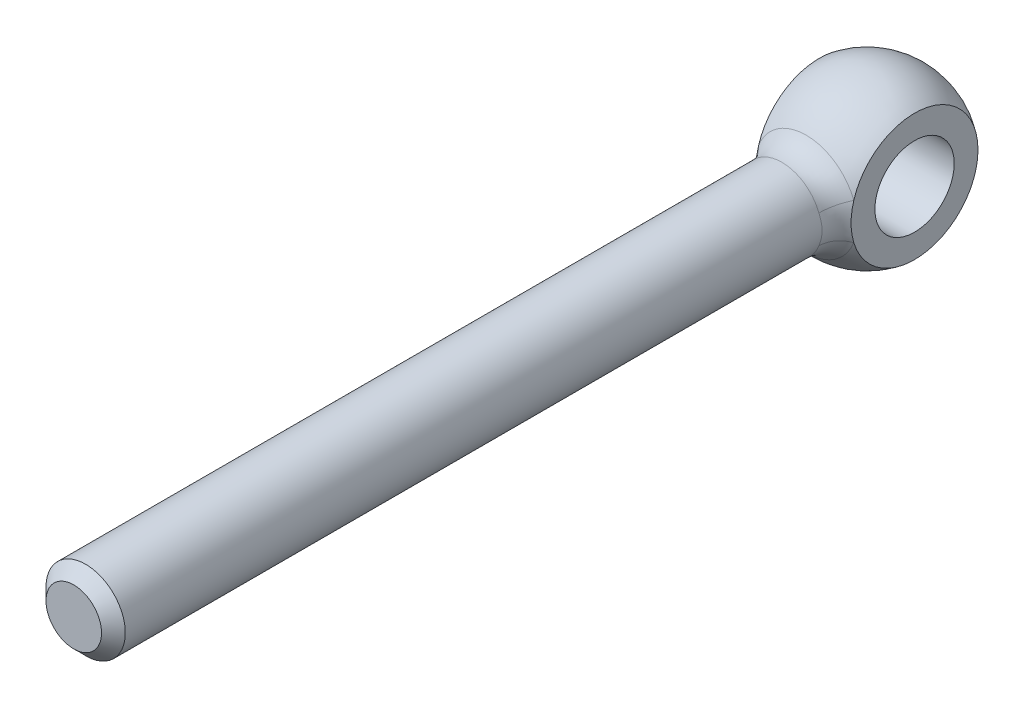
ISO-10303-21;
HEADER;
FILE_DESCRIPTION(('STEP AP214'),'2;1');
FILE_NAME('part.step','',(''),(''),'','','');
FILE_SCHEMA(('AUTOMOTIVE_DESIGN { 1 0 10303 214 1 1 1 1 }'));
ENDSEC;
DATA;
#1=APPLICATION_CONTEXT('core data for automotive mechanical design processes');
#2=APPLICATION_PROTOCOL_DEFINITION('international standard','automotive_design',2000,#1);
#3=PRODUCT_CONTEXT('',#1,'mechanical');
#4=PRODUCT('Part','Part','',(#3));
#5=PRODUCT_RELATED_PRODUCT_CATEGORY('part','',(#4));
#6=PRODUCT_DEFINITION_FORMATION('','',#4);
#7=PRODUCT_DEFINITION_CONTEXT('part definition',#1,'design');
#8=PRODUCT_DEFINITION('design','',#6,#7);
#9=PRODUCT_DEFINITION_SHAPE('','',#8);
#10=(LENGTH_UNIT() NAMED_UNIT(*) SI_UNIT(.MILLI.,.METRE.));
#11=(NAMED_UNIT(*) PLANE_ANGLE_UNIT() SI_UNIT($,.RADIAN.));
#12=(NAMED_UNIT(*) SI_UNIT($,.STERADIAN.) SOLID_ANGLE_UNIT());
#13=UNCERTAINTY_MEASURE_WITH_UNIT(LENGTH_MEASURE(1.E-05),#10,'distance_accuracy_value','');
#14=(GEOMETRIC_REPRESENTATION_CONTEXT(3) GLOBAL_UNCERTAINTY_ASSIGNED_CONTEXT((#13)) GLOBAL_UNIT_ASSIGNED_CONTEXT((#10,
#11,#12)) REPRESENTATION_CONTEXT('',''));
#15=CARTESIAN_POINT('',(0.,0.,0.));
#16=DIRECTION('',(0.,0.,1.));
#17=DIRECTION('',(1.,0.,0.));
#18=AXIS2_PLACEMENT_3D('',#15,#16,#17);
#19=CARTESIAN_POINT('',(0.,0.,0.));
#20=DIRECTION('',(1.,0.,0.));
#21=DIRECTION('',(0.,0.,-1.));
#22=AXIS2_PLACEMENT_3D('',#19,#20,#21);
#23=SPHERICAL_SURFACE('',#22,10.);
#24=CARTESIAN_POINT('',(-6.,0.,0.));
#25=DIRECTION('',(-1.,0.,0.));
#26=DIRECTION('',(0.,0.,1.));
#27=AXIS2_PLACEMENT_3D('',#24,#25,#26);
#28=CIRCLE('',#27,8.);
#29=CARTESIAN_POINT('',(-6.,-2.30792777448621,7.65986092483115));
#30=VERTEX_POINT('',#29);
#31=CARTESIAN_POINT('',(-6.,2.30792777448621,7.65986092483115));
#32=VERTEX_POINT('',#31);
#33=EDGE_CURVE('E65',#30,#32,#28,.F.);
#34=ORIENTED_EDGE('',*,*,#33,.T.);
#35=CARTESIAN_POINT('',(0.,0.,7.65986092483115));
#36=DIRECTION('',(0.,0.,-1.));
#37=DIRECTION('',(-1.,0.,0.));
#38=AXIS2_PLACEMENT_3D('',#35,#36,#37);
#39=CIRCLE('',#38,6.42857142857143);
#40=CARTESIAN_POINT('',(6.,2.30792777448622,7.65986092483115));
#41=VERTEX_POINT('',#40);
#42=EDGE_CURVE('E73',#32,#41,#39,.T.);
#43=ORIENTED_EDGE('',*,*,#42,.T.);
#44=CARTESIAN_POINT('',(6.,0.,0.));
#45=DIRECTION('',(-1.,0.,0.));
#46=DIRECTION('',(0.,0.,1.));
#47=AXIS2_PLACEMENT_3D('',#44,#45,#46);
#48=CIRCLE('',#47,8.);
#49=CARTESIAN_POINT('',(6.,-2.30792777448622,7.65986092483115));
#50=VERTEX_POINT('',#49);
#51=EDGE_CURVE('E61',#50,#41,#48,.F.);
#52=ORIENTED_EDGE('',*,*,#51,.F.);
#53=CARTESIAN_POINT('',(0.,0.,7.65986092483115));
#54=DIRECTION('',(0.,0.,-1.));
#55=DIRECTION('',(-1.,0.,0.));
#56=AXIS2_PLACEMENT_3D('',#53,#54,#55);
#57=CIRCLE('',#56,6.42857142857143);
#58=EDGE_CURVE('E70',#50,#30,#57,.T.);
#59=ORIENTED_EDGE('',*,*,#58,.T.);
#60=EDGE_LOOP('',(#34,#43,#52,#59));
#61=FACE_BOUND('',#60,.T.);
#62=ADVANCED_FACE('F14',(#61),#23,.T.);
#63=CARTESIAN_POINT('',(0.,0.,-10.));
#64=DIRECTION('',(0.,0.,-1.));
#65=DIRECTION('',(-1.,0.,0.));
#66=AXIS2_PLACEMENT_3D('',#63,#64,#65);
#67=CYLINDRICAL_SURFACE('',#66,5.);
#68=CARTESIAN_POINT('',(-6.,-3.22673231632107,7.32039606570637));
#69=CARTESIAN_POINT('',(-4.39277938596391,-2.40032191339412,8.49810177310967));
#70=CARTESIAN_POINT('',(-4.26719928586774,-2.60595668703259,10.6417078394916));
#71=CARTESIAN_POINT('',(-6.,-3.1563799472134,7.35140196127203));
#72=CARTESIAN_POINT('',(-4.41396770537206,-2.35868794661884,8.53415924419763));
#73=CARTESIAN_POINT('',(-4.30636952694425,-2.54182050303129,10.6569167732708));
#74=CARTESIAN_POINT('',(-6.,-3.08456786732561,7.38184900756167));
#75=CARTESIAN_POINT('',(-4.43598568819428,-2.31489371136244,8.56888423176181));
#76=CARTESIAN_POINT('',(-4.34415743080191,-2.47668749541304,10.6696741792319));
#77=CARTESIAN_POINT('',(-6.,-2.93788308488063,7.44144632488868));
#78=CARTESIAN_POINT('',(-4.48100668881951,-2.2229678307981,8.63529633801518));
#79=CARTESIAN_POINT('',(-4.41682149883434,-2.34464512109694,10.6908098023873));
#80=CARTESIAN_POINT('',(-6.,-2.86301195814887,7.47059724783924));
#81=CARTESIAN_POINT('',(-4.50400416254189,-2.17486027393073,8.66699992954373));
#82=CARTESIAN_POINT('',(-4.45169913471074,-2.27773667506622,10.6991902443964));
#83=CARTESIAN_POINT('',(-6.,-2.63359255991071,7.55584558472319));
#84=CARTESIAN_POINT('',(-4.5734661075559,-2.02411950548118,8.75712422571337));
#85=CARTESIAN_POINT('',(-4.5517588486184,-2.07466593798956,10.7185614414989));
#86=CARTESIAN_POINT('',(-6.,-2.474143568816,7.60978095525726));
#87=CARTESIAN_POINT('',(-4.62076994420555,-1.91438028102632,8.81115716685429));
#88=CARTESIAN_POINT('',(-4.61242106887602,-1.93607097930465,10.7238012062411));
#89=CARTESIAN_POINT('',(-6.,-2.15560728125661,7.70575431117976));
#90=CARTESIAN_POINT('',(-4.70836207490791,-1.68665244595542,8.90207343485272));
#91=CARTESIAN_POINT('',(-4.71637744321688,-1.66582754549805,10.7238090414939));
#92=CARTESIAN_POINT('',(-6.,-1.99760407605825,7.74840995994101));
#93=CARTESIAN_POINT('',(-4.74893525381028,-1.57023745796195,8.94011459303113));
#94=CARTESIAN_POINT('',(-4.76069958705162,-1.53456694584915,10.719415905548));
#95=CARTESIAN_POINT('',(-6.,-1.67034421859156,7.82548342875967));
#96=CARTESIAN_POINT('',(-4.82366839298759,-1.32353889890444,9.00539080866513));
#97=CARTESIAN_POINT('',(-4.83830988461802,-1.26882691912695,10.7060668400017));
#98=CARTESIAN_POINT('',(-6.,-1.50108215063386,7.85989724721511));
#99=CARTESIAN_POINT('',(-4.8579211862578,-1.19318069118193,9.03274138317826));
#100=CARTESIAN_POINT('',(-4.87159268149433,-1.13434596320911,10.6971087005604));
#101=CARTESIAN_POINT('',(-6.,-1.15262565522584,7.91850047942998));
#102=CARTESIAN_POINT('',(-4.91671483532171,-0.921194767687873,9.077312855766));
#103=CARTESIAN_POINT('',(-4.92691418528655,-0.862968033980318,10.6789999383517));
#104=CARTESIAN_POINT('',(-6.,-0.973422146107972,7.94268036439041));
#105=CARTESIAN_POINT('',(-4.9413541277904,-0.779366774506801,9.09462093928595));
#106=CARTESIAN_POINT('',(-4.94894241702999,-0.726068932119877,10.6698491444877));
#107=CARTESIAN_POINT('',(-6.,-0.608286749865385,7.97894634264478));
#108=CARTESIAN_POINT('',(-4.97835060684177,-0.488614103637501,9.11990305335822));
#109=CARTESIAN_POINT('',(-4.98155564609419,-0.450879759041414,10.6552429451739));
#110=CARTESIAN_POINT('',(-6.,-0.422356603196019,7.99103554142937));
#111=CARTESIAN_POINT('',(-4.99079415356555,-0.339389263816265,9.12793953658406));
#112=CARTESIAN_POINT('',(-4.99214358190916,-0.312590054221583,10.6497865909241));
#113=CARTESIAN_POINT('',(-6.,-0.0470401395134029,8.00207760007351));
#114=CARTESIAN_POINT('',(-5.00212876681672,-0.0379597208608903,9.13527953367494));
#115=CARTESIAN_POINT('',(-5.00182656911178,-0.0346295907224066,10.6448278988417));
#116=CARTESIAN_POINT('',(-6.,0.142361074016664,8.00094068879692));
#117=CARTESIAN_POINT('',(-5.00095572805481,0.114635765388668,9.13454178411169));
#118=CARTESIAN_POINT('',(-5.00084307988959,0.105044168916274,10.6453662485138));
#119=CARTESIAN_POINT('',(-6.,0.518101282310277,7.98542192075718));
#120=CARTESIAN_POINT('',(-4.98503390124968,0.41617577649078,9.12417872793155));
#121=CARTESIAN_POINT('',(-4.98720206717,0.383785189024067,10.6522685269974));
#122=CARTESIAN_POINT('',(-6.,0.704439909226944,7.97103848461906));
#123=CARTESIAN_POINT('',(-4.97024377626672,0.565490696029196,9.1145264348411));
#124=CARTESIAN_POINT('',(-4.97454315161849,0.522852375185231,10.6586331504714));
#125=CARTESIAN_POINT('',(-6.,1.06953275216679,7.9303143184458));
#126=CARTESIAN_POINT('',(-4.9287833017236,0.855453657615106,9.08576459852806));
#127=CARTESIAN_POINT('',(-4.93766171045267,0.799340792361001,10.6744961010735));
#128=CARTESIAN_POINT('',(-6.,1.24828905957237,7.90397690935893));
#129=CARTESIAN_POINT('',(-4.90202437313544,0.996394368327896,9.06658927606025));
#130=CARTESIAN_POINT('',(-4.91344239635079,0.936762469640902,10.6839935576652));
#131=CARTESIAN_POINT('',(-6.,1.59553267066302,7.84126611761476));
#132=CARTESIAN_POINT('',(-4.83940307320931,1.26604568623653,9.01799513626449));
#133=CARTESIAN_POINT('',(-4.85359923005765,1.2091401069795,10.702003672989));
#134=CARTESIAN_POINT('',(-6.,1.76401873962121,7.80489153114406));
#135=CARTESIAN_POINT('',(-4.80342964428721,1.39492477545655,8.98847099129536));
#136=CARTESIAN_POINT('',(-4.8179740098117,1.3440957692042,10.7105162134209));
#137=CARTESIAN_POINT('',(-6.,2.08964087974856,7.72409129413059));
#138=CARTESIAN_POINT('',(-4.72580116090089,1.63827856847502,8.91856012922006));
#139=CARTESIAN_POINT('',(-4.7355062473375,1.61073332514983,10.7220684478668));
#140=CARTESIAN_POINT('',(-6.,2.24676904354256,7.67966010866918));
#141=CARTESIAN_POINT('',(-4.68404997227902,1.75278972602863,8.87803958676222));
#142=CARTESIAN_POINT('',(-4.68865598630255,1.74241289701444,10.7251043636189));
#143=CARTESIAN_POINT('',(-6.,2.54938211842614,7.58457698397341));
#144=CARTESIAN_POINT('',(-4.59869902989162,1.96626184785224,8.78604729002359));
#145=CARTESIAN_POINT('',(-4.58413287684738,2.00130006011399,10.7214381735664));
#146=CARTESIAN_POINT('',(-6.,2.69487333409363,7.53392845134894));
#147=CARTESIAN_POINT('',(-4.55505237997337,2.06517694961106,8.73445253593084));
#148=CARTESIAN_POINT('',(-4.52646594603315,2.12851005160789,10.7147413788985));
#149=CARTESIAN_POINT('',(-6.,2.97563340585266,7.42753384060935));
#150=CARTESIAN_POINT('',(-4.46945882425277,2.24823791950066,8.62043143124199));
#151=CARTESIAN_POINT('',(-4.40053898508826,2.37799449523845,10.6877579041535));
#152=CARTESIAN_POINT('',(-6.,3.1108468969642,7.37176329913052));
#153=CARTESIAN_POINT('',(-4.42753255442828,2.33217907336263,8.55784369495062));
#154=CARTESIAN_POINT('',(-4.33222690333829,2.50024076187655,10.6674027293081));
#155=CARTESIAN_POINT('',(-6.,3.30618612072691,7.28520546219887));
#156=CARTESIAN_POINT('',(-4.36877466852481,2.44740194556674,8.45689846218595));
#157=CARTESIAN_POINT('',(-4.2226645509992,2.67843096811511,10.6241540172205));
#158=CARTESIAN_POINT('',(-6.,3.37012775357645,7.25583055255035));
#159=CARTESIAN_POINT('',(-4.3497996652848,2.48417205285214,8.42189416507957));
#160=CARTESIAN_POINT('',(-4.18490963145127,2.73703466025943,10.6075896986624));
#161=CARTESIAN_POINT('',(-6.,3.49564302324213,7.19620015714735));
#162=CARTESIAN_POINT('',(-4.31353045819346,2.55449740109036,8.34959125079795));
#163=CARTESIAN_POINT('',(-4.10720301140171,2.85231842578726,10.5698584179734));
#164=CARTESIAN_POINT('',(-6.,3.55721601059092,7.16594443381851));
#165=CARTESIAN_POINT('',(-4.2962467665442,2.58803247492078,8.31228600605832));
#166=CARTESIAN_POINT('',(-4.06725071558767,2.90899797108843,10.5486902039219));
#167=CARTESIAN_POINT('',(-6.,3.61768386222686,7.13529000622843));
#168=CARTESIAN_POINT('',(-4.28001098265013,2.62004266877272,8.27400289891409));
#169=CARTESIAN_POINT('',(-4.02628463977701,2.96463016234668,10.5250470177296));
#170=(BOUNDED_SURFACE() B_SPLINE_SURFACE(3,2,((#68,#69,#70),(#71,#72,#73),(#74,#75,#76),(#77,
#78,#79),(#80,#81,#82),(#83,#84,#85),(#86,#87,#88),(#89,#90,#91),(#92,#93,#94),(#95,#96,#97),
(#98,#99,#100),(#101,#102,#103),(#104,#105,#106),(#107,#108,#109),(#110,#111,#112),(#113,#114,
#115),(#116,#117,#118),(#119,#120,#121),(#122,#123,#124),(#125,#126,#127),(#128,#129,#130),
(#131,#132,#133),(#134,#135,#136),(#137,#138,#139),(#140,#141,#142),(#143,#144,#145),(#146,#147,
#148),(#149,#150,#151),(#152,#153,#154),(#155,#156,#157),(#158,#159,#160),(#161,#162,#163),
(#164,#165,#166),(#167,#168,#169)),.UNSPECIFIED.,.F.,.F.,.F.) B_SPLINE_SURFACE_WITH_KNOTS((4,2,
2,2,2,2,2,2,2,2,2,2,2,2,2,2,4),(3,3),(0.,0.408247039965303,0.816286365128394,1.63181270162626,
2.37916270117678,3.1268748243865,3.87528161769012,4.6234961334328,5.37679204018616,
6.13017777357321,6.8833543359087,7.63662127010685,8.39040767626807,9.14378289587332,
9.90096470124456,10.2805077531,10.6601541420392),(0.,1.),
.UNSPECIFIED.) GEOMETRIC_REPRESENTATION_ITEM() RATIONAL_B_SPLINE_SURFACE(((1.,0.880171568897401,
1.),(1.,0.882376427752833,1.),(1.,0.884598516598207,1.),(1.,0.88904190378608,1.),(1.,
0.891263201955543,1.),(1.,0.897873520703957,1.),(1.,0.902212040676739,1.),(1.,0.910097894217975,
1.),(1.,0.913681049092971,1.),(1.,0.920229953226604,1.),(1.,0.923195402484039,1.),(1.,
0.928274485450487,1.),(1.,0.930387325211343,1.),(1.,0.933563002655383,1.),(1.,0.934626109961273,
1.),(1.,0.935596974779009,1.),(1.,0.935496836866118,1.),(1.,0.934132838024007,1.),(1.,
0.93286883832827,1.),(1.,0.929307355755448,1.),(1.,0.92701015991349,1.),(1.,0.921590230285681,
1.),(1.,0.91846739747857,1.),(1.,0.911637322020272,1.),(1.,0.907929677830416,1.),(1.,
0.900184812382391,1.),(1.,0.896147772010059,1.),(1.,0.88796108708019,1.),(1.,0.88381097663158,
1.),(1.,0.877676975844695,1.),(1.,0.875645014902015,1.),(1.,0.871634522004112,1.),(1.,
0.869656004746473,1.),(1.,0.867715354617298,1.))) REPRESENTATION_ITEM('') SURFACE());
#171=CARTESIAN_POINT('',(-4.02628463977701,2.96463016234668,10.5250470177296));
#172=CARTESIAN_POINT('',(-4.06725071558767,2.90899797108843,10.5486902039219));
#173=CARTESIAN_POINT('',(-4.10720301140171,2.85231842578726,10.5698584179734));
#174=CARTESIAN_POINT('',(-4.18490963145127,2.73703466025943,10.6075896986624));
#175=CARTESIAN_POINT('',(-4.2226645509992,2.67843096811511,10.6241540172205));
#176=CARTESIAN_POINT('',(-4.33222690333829,2.50024076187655,10.6674027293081));
#177=CARTESIAN_POINT('',(-4.40053898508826,2.37799449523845,10.6877579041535));
#178=CARTESIAN_POINT('',(-4.52646594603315,2.12851005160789,10.7147413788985));
#179=CARTESIAN_POINT('',(-4.58413287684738,2.00130006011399,10.7214381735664));
#180=CARTESIAN_POINT('',(-4.68865598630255,1.74241289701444,10.7251043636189));
#181=CARTESIAN_POINT('',(-4.7355062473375,1.61073332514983,10.7220684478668));
#182=CARTESIAN_POINT('',(-4.8179740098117,1.3440957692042,10.7105162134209));
#183=CARTESIAN_POINT('',(-4.85359923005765,1.2091401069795,10.702003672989));
#184=CARTESIAN_POINT('',(-4.91344239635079,0.936762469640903,10.6839935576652));
#185=CARTESIAN_POINT('',(-4.93766171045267,0.799340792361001,10.6744961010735));
#186=CARTESIAN_POINT('',(-4.97454315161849,0.52285237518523,10.6586331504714));
#187=CARTESIAN_POINT('',(-4.98720206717,0.383785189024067,10.6522685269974));
#188=CARTESIAN_POINT('',(-5.00084307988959,0.105044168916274,10.6453662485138));
#189=CARTESIAN_POINT('',(-5.00182656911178,-0.0346295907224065,10.6448278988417));
#190=CARTESIAN_POINT('',(-4.99214358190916,-0.312590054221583,10.6497865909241));
#191=CARTESIAN_POINT('',(-4.98155564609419,-0.450879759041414,10.6552429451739));
#192=CARTESIAN_POINT('',(-4.94894241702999,-0.726068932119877,10.6698491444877));
#193=CARTESIAN_POINT('',(-4.92691418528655,-0.862968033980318,10.6789999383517));
#194=CARTESIAN_POINT('',(-4.87159268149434,-1.13434596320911,10.6971087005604));
#195=CARTESIAN_POINT('',(-4.83830988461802,-1.26882691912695,10.7060668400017));
#196=CARTESIAN_POINT('',(-4.76069958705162,-1.53456694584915,10.719415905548));
#197=CARTESIAN_POINT('',(-4.71637744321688,-1.66582754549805,10.7238090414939));
#198=CARTESIAN_POINT('',(-4.61242106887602,-1.93607097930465,10.7238012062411));
#199=CARTESIAN_POINT('',(-4.5517588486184,-2.07466593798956,10.7185614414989));
#200=CARTESIAN_POINT('',(-4.45169913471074,-2.27773667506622,10.6991902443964));
#201=CARTESIAN_POINT('',(-4.41682149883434,-2.34464512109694,10.6908098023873));
#202=CARTESIAN_POINT('',(-4.34415743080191,-2.47668749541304,10.6696741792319));
#203=CARTESIAN_POINT('',(-4.30636952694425,-2.54182050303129,10.6569167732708));
#204=CARTESIAN_POINT('',(-4.26719928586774,-2.60595668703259,10.6417078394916));
#205=B_SPLINE_CURVE_WITH_KNOTS('',3,(#171,#172,#173,#174,#175,#176,#177,#178,#179,#180,#181,
#182,#183,#184,#185,#186,#187,#188,#189,#190,#191,#192,#193,#194,#195,#196,#197,#198,#199,#200,
#201,#202,#203,#204),.UNSPECIFIED.,.F.,.F.,(4,2,2,2,2,2,2,2,2,2,2,2,2,2,2,2,4),(0.,
0.379646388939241,0.759189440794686,1.51637124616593,2.26974646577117,3.02353287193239,
3.77679980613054,4.52997636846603,5.28336210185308,6.03665800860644,6.78487252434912,
7.53327931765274,8.28099144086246,9.02834144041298,9.84386777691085,10.2519071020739,
10.6601541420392),.UNSPECIFIED.);
#206=CARTESIAN_POINT('',(-4.66666666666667,1.7950549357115,10.7238052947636));
#207=VERTEX_POINT('',#206);
#208=CARTESIAN_POINT('',(-4.66666666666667,-1.7950549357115,10.7238052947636));
#209=VERTEX_POINT('',#208);
#210=EDGE_CURVE('E88',#207,#209,#205,.T.);
#211=ORIENTED_EDGE('',*,*,#210,.T.);
#212=CARTESIAN_POINT('',(0.,0.,10.7238052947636));
#213=DIRECTION('',(0.,0.,-1.));
#214=DIRECTION('',(-1.,0.,0.));
#215=AXIS2_PLACEMENT_3D('',#212,#213,#214);
#216=CIRCLE('',#215,5.);
#217=CARTESIAN_POINT('',(4.66666666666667,-1.79505493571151,10.7238052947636));
#218=VERTEX_POINT('',#217);
#219=EDGE_CURVE('E9',#209,#218,#216,.F.);
#220=ORIENTED_EDGE('',*,*,#219,.T.);
#221=CARTESIAN_POINT('',(6.,3.2267323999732,7.32039602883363));
#222=CARTESIAN_POINT('',(4.39277936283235,2.40032195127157,8.4981017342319));
#223=CARTESIAN_POINT('',(4.26719928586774,2.60595668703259,10.6417078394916));
#224=CARTESIAN_POINT('',(6.,3.15637997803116,7.35140194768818));
#225=CARTESIAN_POINT('',(4.41396769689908,2.35868796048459,8.53415922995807));
#226=CARTESIAN_POINT('',(4.30636952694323,2.54182050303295,10.6569167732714));
#227=CARTESIAN_POINT('',(6.,3.08456787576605,7.38184900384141));
#228=CARTESIAN_POINT('',(4.43598568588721,2.31489371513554,8.5688842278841));
#229=CARTESIAN_POINT('',(4.34415743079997,2.47668749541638,10.6696741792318));
#230=CARTESIAN_POINT('',(6.,2.93788307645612,7.44144632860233));
#231=CARTESIAN_POINT('',(4.48100669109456,2.22296782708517,8.63529634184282));
#232=CARTESIAN_POINT('',(4.41682149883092,2.34464512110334,10.6908098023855));
#233=CARTESIAN_POINT('',(6.,2.86301195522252,7.47059724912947));
#234=CARTESIAN_POINT('',(4.50400416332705,2.17486027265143,8.66699993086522));
#235=CARTESIAN_POINT('',(4.45169913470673,2.27773667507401,10.6991902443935));
#236=CARTESIAN_POINT('',(6.,2.63359256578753,7.55584558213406));
#237=CARTESIAN_POINT('',(4.57346610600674,2.02411950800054,8.75712422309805));
#238=CARTESIAN_POINT('',(4.55175884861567,2.07466593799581,10.7185614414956));
#239=CARTESIAN_POINT('',(6.,2.4741435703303,7.60978095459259));
#240=CARTESIAN_POINT('',(4.62076994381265,1.91438028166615,8.81115716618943));
#241=CARTESIAN_POINT('',(4.61242106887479,1.93607097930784,10.7238012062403));
#242=CARTESIAN_POINT('',(6.,2.1556072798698,7.7057543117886));
#243=CARTESIAN_POINT('',(4.7083620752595,1.68665244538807,8.90207343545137));
#244=CARTESIAN_POINT('',(4.71637744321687,1.66582754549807,10.7238090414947));
#245=CARTESIAN_POINT('',(6.,1.99760407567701,7.74840996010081));
#246=CARTESIAN_POINT('',(4.74893525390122,1.57023745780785,8.9401145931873));
#247=CARTESIAN_POINT('',(4.76069958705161,1.53456694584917,10.7194159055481));
#248=CARTESIAN_POINT('',(6.,1.67034421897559,7.82548342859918));
#249=CARTESIAN_POINT('',(4.82366839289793,1.32353889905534,9.0053908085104));
#250=CARTESIAN_POINT('',(4.83830988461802,1.26882691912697,10.7060668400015));
#251=CARTESIAN_POINT('',(6.,1.50108215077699,7.85989724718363));
#252=CARTESIAN_POINT('',(4.85792118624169,1.19318069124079,9.03274138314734));
#253=CARTESIAN_POINT('',(4.87159268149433,1.13434596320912,10.6971087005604));
#254=CARTESIAN_POINT('',(6.,1.15262565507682,7.91850047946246));
#255=CARTESIAN_POINT('',(4.91671483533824,0.921194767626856,9.07731285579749));
#256=CARTESIAN_POINT('',(4.92691418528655,0.862968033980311,10.6789999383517));
#257=CARTESIAN_POINT('',(6.,0.973422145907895,7.94268036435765));
#258=CARTESIAN_POINT('',(4.94135412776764,0.779366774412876,9.09462093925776));
#259=CARTESIAN_POINT('',(4.94894241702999,0.726068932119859,10.6698491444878));
#260=CARTESIAN_POINT('',(6.,0.60828675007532,7.97894634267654));
#261=CARTESIAN_POINT('',(4.97835060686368,0.488614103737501,9.11990305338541));
#262=CARTESIAN_POINT('',(4.98155564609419,0.450879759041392,10.6552429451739));
#263=CARTESIAN_POINT('',(6.,0.422356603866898,7.99103554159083));
#264=CARTESIAN_POINT('',(4.99079415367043,0.339389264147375,9.12793953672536));
#265=CARTESIAN_POINT('',(4.99214358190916,0.312590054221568,10.6497865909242));
#266=CARTESIAN_POINT('',(6.,0.0470401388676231,8.00207759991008));
#267=CARTESIAN_POINT('',(5.00212876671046,0.03795972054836,9.13527953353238));
#268=CARTESIAN_POINT('',(5.00182656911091,0.0346295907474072,10.6448278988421));
#269=CARTESIAN_POINT('',(6.,-0.142361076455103,8.00094068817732));
#270=CARTESIAN_POINT('',(5.00095572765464,-0.114635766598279,9.13454178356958));
#271=CARTESIAN_POINT('',(5.00084307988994,-0.105044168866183,10.6453662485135));
#272=CARTESIAN_POINT('',(6.,-0.51810127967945,7.98542192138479));
#273=CARTESIAN_POINT('',(4.98503390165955,-0.416175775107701,9.12417872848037));
#274=CARTESIAN_POINT('',(4.98720206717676,-0.383785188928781,10.652268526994));
#275=CARTESIAN_POINT('',(6.,-0.704439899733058,7.97103848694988));
#276=CARTESIAN_POINT('',(4.97024377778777,-0.565490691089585,9.11452643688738));
#277=CARTESIAN_POINT('',(4.97454315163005,-0.522852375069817,10.6586331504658));
#278=CARTESIAN_POINT('',(6.,-1.0695327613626,7.9303143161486));
#279=CARTESIAN_POINT('',(4.92878330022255,-0.855453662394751,9.08576459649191));
#280=CARTESIAN_POINT('',(4.93766171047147,-0.799340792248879,10.674496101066));
#281=CARTESIAN_POINT('',(6.,-1.24828909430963,7.90397690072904));
#282=CARTESIAN_POINT('',(4.90202436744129,-0.996394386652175,9.06658926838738));
#283=CARTESIAN_POINT('',(4.91344239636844,-0.936762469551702,10.6839935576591));
#284=CARTESIAN_POINT('',(6.,-1.59553263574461,7.84126612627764));
#285=CARTESIAN_POINT('',(4.83940307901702,-1.26604566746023,9.01799514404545));
#286=CARTESIAN_POINT('',(4.85359923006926,-1.2091401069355,10.7020036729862));
#287=CARTESIAN_POINT('',(6.,-1.7640186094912,7.804891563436));
#288=CARTESIAN_POINT('',(4.80342966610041,-1.39492470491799,8.98847102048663));
#289=CARTESIAN_POINT('',(4.81797400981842,-1.34409576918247,10.7105162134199));
#290=CARTESIAN_POINT('',(6.,-2.08964074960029,7.7240913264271));
#291=CARTESIAN_POINT('',(4.72580118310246,-1.63827849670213,8.91856015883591));
#292=CARTESIAN_POINT('',(4.73550624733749,-1.61073332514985,10.7220684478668));
#293=CARTESIAN_POINT('',(6.,-2.24676900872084,7.67966011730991));
#294=CARTESIAN_POINT('',(4.68404997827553,-1.75278970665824,8.87803959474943));
#295=CARTESIAN_POINT('',(4.68865598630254,-1.74241289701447,10.7251043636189));
#296=CARTESIAN_POINT('',(6.,-2.54938215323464,7.58457697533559));
#297=CARTESIAN_POINT('',(4.59869902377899,-1.96626186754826,8.78604728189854));
#298=CARTESIAN_POINT('',(4.58413287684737,-2.00130006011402,10.7214381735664));
#299=CARTESIAN_POINT('',(6.,-2.69487334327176,7.53392844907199));
#300=CARTESIAN_POINT('',(4.55505237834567,-2.06517695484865,8.73445253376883));
#301=CARTESIAN_POINT('',(4.52646594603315,-2.1285100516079,10.7147413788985));
#302=CARTESIAN_POINT('',(6.,-2.97563339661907,7.42753384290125));
#303=CARTESIAN_POINT('',(4.46945882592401,-2.24823791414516,8.62043143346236));
#304=CARTESIAN_POINT('',(4.40053898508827,-2.37799449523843,10.6877579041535));
#305=CARTESIAN_POINT('',(6.,-3.11084689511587,7.37176329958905));
#306=CARTESIAN_POINT('',(4.42753255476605,-2.33217907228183,8.55784369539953));
#307=CARTESIAN_POINT('',(4.33222690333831,-2.50024076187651,10.6674027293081));
#308=CARTESIAN_POINT('',(6.,-3.30618612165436,7.2852054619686));
#309=CARTESIAN_POINT('',(4.36877466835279,-2.44740194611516,8.45689846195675));
#310=CARTESIAN_POINT('',(4.22266455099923,-2.67843096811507,10.6241540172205));
#311=CARTESIAN_POINT('',(6.,-3.37012775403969,7.25583055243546));
#312=CARTESIAN_POINT('',(4.34979966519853,-2.48417205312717,8.4218941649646));
#313=CARTESIAN_POINT('',(4.1849096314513,-2.73703466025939,10.6075896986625));
#314=CARTESIAN_POINT('',(6.,-3.49564302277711,7.19620015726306));
#315=CARTESIAN_POINT('',(4.31353045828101,-2.5544974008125,8.34959125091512));
#316=CARTESIAN_POINT('',(4.10720301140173,-2.85231842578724,10.5698584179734));
#317=CARTESIAN_POINT('',(6.,-3.55721600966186,7.16594443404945));
#318=CARTESIAN_POINT('',(4.29624676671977,-2.58803247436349,8.31228600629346));
#319=CARTESIAN_POINT('',(4.06725071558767,-2.90899797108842,10.5486902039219));
#320=CARTESIAN_POINT('',(6.,-3.61768386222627,7.13529000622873));
#321=CARTESIAN_POINT('',(4.2800109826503,-2.62004266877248,8.27400289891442));
#322=CARTESIAN_POINT('',(4.02628463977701,-2.96463016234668,10.5250470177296));
#323=(BOUNDED_SURFACE() B_SPLINE_SURFACE(3,2,((#221,#222,#223),(#224,#225,#226),(#227,#228,
#229),(#230,#231,#232),(#233,#234,#235),(#236,#237,#238),(#239,#240,#241),(#242,#243,#244),
(#245,#246,#247),(#248,#249,#250),(#251,#252,#253),(#254,#255,#256),(#257,#258,#259),(#260,#261,
#262),(#263,#264,#265),(#266,#267,#268),(#269,#270,#271),(#272,#273,#274),(#275,#276,#277),
(#278,#279,#280),(#281,#282,#283),(#284,#285,#286),(#287,#288,#289),(#290,#291,#292),(#293,#294,
#295),(#296,#297,#298),(#299,#300,#301),(#302,#303,#304),(#305,#306,#307),(#308,#309,#310),
(#311,#312,#313),(#314,#315,#316),(#317,#318,#319),(#320,#321,#322)),.UNSPECIFIED.,.F.,.F.,
.F.) B_SPLINE_SURFACE_WITH_KNOTS((4,2,2,2,2,2,2,2,2,2,2,2,2,2,2,2,4),(3,3),(0.,
0.408247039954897,0.816286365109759,1.63181270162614,2.37916270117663,3.12687482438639,
3.87528161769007,4.62349613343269,5.37679204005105,6.1301777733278,6.88335433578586,
7.63662127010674,8.39040767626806,9.1437828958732,9.90096470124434,10.2805077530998,
10.6601541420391),(0.,1.),
.UNSPECIFIED.) GEOMETRIC_REPRESENTATION_ITEM() RATIONAL_B_SPLINE_SURFACE(((1.,0.880171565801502,
1.),(1.,0.882376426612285,1.),(1.,0.884598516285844,1.),(1.,0.88904190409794,1.),(1.,
0.891263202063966,1.),(1.,0.89787352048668,1.),(1.,0.902212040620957,1.),(1.,0.910097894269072,
1.),(1.,0.913681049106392,1.),(1.,0.920229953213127,1.),(1.,0.923195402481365,1.),(1.,
0.928274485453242,1.),(1.,0.930387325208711,1.),(1.,0.933563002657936,1.),(1.,0.934626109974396,
1.),(1.,0.935596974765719,1.),(1.,0.935496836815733,1.),(1.,0.934132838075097,1.),(1.,
0.932868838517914,1.),(1.,0.929307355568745,1.),(1.,0.927010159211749,1.),(1.,0.921590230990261,
1.),(1.,0.918467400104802,1.),(1.,0.911637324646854,1.),(1.,0.907929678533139,1.),(1.,
0.900184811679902,1.),(1.,0.896147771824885,1.),(1.,0.887961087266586,1.),(1.,0.88381097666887,
1.),(1.,0.877676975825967,1.),(1.,0.875645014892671,1.),(1.,0.871634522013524,1.),(1.,
0.869656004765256,1.),(1.,0.867715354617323,1.))) REPRESENTATION_ITEM('') SURFACE());
#324=CARTESIAN_POINT('',(4.02628463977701,-2.96463016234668,10.5250470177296));
#325=CARTESIAN_POINT('',(4.06725071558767,-2.90899797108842,10.5486902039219));
#326=CARTESIAN_POINT('',(4.10720301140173,-2.85231842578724,10.5698584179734));
#327=CARTESIAN_POINT('',(4.1849096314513,-2.73703466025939,10.6075896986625));
#328=CARTESIAN_POINT('',(4.22266455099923,-2.67843096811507,10.6241540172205));
#329=CARTESIAN_POINT('',(4.33222690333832,-2.50024076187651,10.6674027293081));
#330=CARTESIAN_POINT('',(4.40053898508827,-2.37799449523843,10.6877579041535));
#331=CARTESIAN_POINT('',(4.52646594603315,-2.1285100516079,10.7147413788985));
#332=CARTESIAN_POINT('',(4.58413287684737,-2.00130006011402,10.7214381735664));
#333=CARTESIAN_POINT('',(4.68865598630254,-1.74241289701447,10.7251043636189));
#334=CARTESIAN_POINT('',(4.73550624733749,-1.61073332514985,10.7220684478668));
#335=CARTESIAN_POINT('',(4.81797400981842,-1.34409576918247,10.7105162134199));
#336=CARTESIAN_POINT('',(4.85359923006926,-1.2091401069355,10.7020036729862));
#337=CARTESIAN_POINT('',(4.91344239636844,-0.936762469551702,10.6839935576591));
#338=CARTESIAN_POINT('',(4.93766171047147,-0.799340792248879,10.674496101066));
#339=CARTESIAN_POINT('',(4.97454315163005,-0.522852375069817,10.6586331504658));
#340=CARTESIAN_POINT('',(4.98720206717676,-0.383785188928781,10.652268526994));
#341=CARTESIAN_POINT('',(5.00084307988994,-0.105044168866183,10.6453662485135));
#342=CARTESIAN_POINT('',(5.00182656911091,0.0346295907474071,10.6448278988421));
#343=CARTESIAN_POINT('',(4.99214358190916,0.312590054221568,10.6497865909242));
#344=CARTESIAN_POINT('',(4.98155564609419,0.450879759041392,10.6552429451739));
#345=CARTESIAN_POINT('',(4.94894241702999,0.726068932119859,10.6698491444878));
#346=CARTESIAN_POINT('',(4.92691418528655,0.862968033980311,10.6789999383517));
#347=CARTESIAN_POINT('',(4.87159268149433,1.13434596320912,10.6971087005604));
#348=CARTESIAN_POINT('',(4.83830988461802,1.26882691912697,10.7060668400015));
#349=CARTESIAN_POINT('',(4.76069958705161,1.53456694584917,10.7194159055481));
#350=CARTESIAN_POINT('',(4.71637744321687,1.66582754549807,10.7238090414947));
#351=CARTESIAN_POINT('',(4.61242106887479,1.93607097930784,10.7238012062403));
#352=CARTESIAN_POINT('',(4.55175884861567,2.07466593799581,10.7185614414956));
#353=CARTESIAN_POINT('',(4.45169913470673,2.27773667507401,10.6991902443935));
#354=CARTESIAN_POINT('',(4.41682149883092,2.34464512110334,10.6908098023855));
#355=CARTESIAN_POINT('',(4.34415743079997,2.47668749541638,10.6696741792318));
#356=CARTESIAN_POINT('',(4.30636952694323,2.54182050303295,10.6569167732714));
#357=CARTESIAN_POINT('',(4.26719928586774,2.60595668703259,10.6417078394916));
#358=B_SPLINE_CURVE_WITH_KNOTS('',3,(#324,#325,#326,#327,#328,#329,#330,#331,#332,#333,#334,
#335,#336,#337,#338,#339,#340,#341,#342,#343,#344,#345,#346,#347,#348,#349,#350,#351,#352,#353,
#354,#355,#356,#357),.UNSPECIFIED.,.F.,.F.,(4,2,2,2,2,2,2,2,2,2,2,2,2,2,2,2,4),(0.,
0.37964638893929,0.759189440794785,1.51637124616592,2.26974646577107,3.02353287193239,
3.77679980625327,4.52997636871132,5.28336210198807,6.03665800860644,6.78487252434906,
7.53327931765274,8.28099144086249,9.02834144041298,9.84386777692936,10.2519071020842,
10.6601541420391),.UNSPECIFIED.);
#359=CARTESIAN_POINT('',(4.66666666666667,1.79505493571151,10.7238052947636));
#360=VERTEX_POINT('',#359);
#361=EDGE_CURVE('E27',#218,#360,#358,.T.);
#362=ORIENTED_EDGE('',*,*,#361,.T.);
#363=CARTESIAN_POINT('',(0.,0.,10.7238052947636));
#364=DIRECTION('',(0.,0.,-1.));
#365=DIRECTION('',(-1.,0.,0.));
#366=AXIS2_PLACEMENT_3D('',#363,#364,#365);
#367=CIRCLE('',#366,5.);
#368=EDGE_CURVE('E101',#360,#207,#367,.F.);
#369=ORIENTED_EDGE('',*,*,#368,.T.);
#370=EDGE_LOOP('',(#211,#220,#362,#369));
#371=FACE_BOUND('',#370,.T.);
#372=CARTESIAN_POINT('',(0.,0.,98.5));
#373=DIRECTION('',(0.,0.,-1.));
#374=DIRECTION('',(-1.,0.,0.));
#375=AXIS2_PLACEMENT_3D('',#372,#373,#374);
#376=CIRCLE('',#375,5.);
#377=CARTESIAN_POINT('',(-5.,0.,98.5));
#378=VERTEX_POINT('',#377);
#379=EDGE_CURVE('E86',#378,#378,#376,.T.);
#380=ORIENTED_EDGE('',*,*,#379,.T.);
#381=EDGE_LOOP('',(#380));
#382=FACE_BOUND('',#381,.T.);
#383=ADVANCED_FACE('F107',(#371,#382),#67,.T.);
#384=CARTESIAN_POINT('',(0.,0.,100.));
#385=DIRECTION('',(0.,0.,-1.));
#386=DIRECTION('',(-1.,0.,0.));
#387=AXIS2_PLACEMENT_3D('',#384,#385,#386);
#388=CONICAL_SURFACE('',#387,3.5,0.785398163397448);
#389=ORIENTED_EDGE('',*,*,#379,.F.);
#390=EDGE_LOOP('',(#389));
#391=FACE_BOUND('',#390,.T.);
#392=CARTESIAN_POINT('',(0.,0.,100.));
#393=DIRECTION('',(0.,0.,-1.));
#394=DIRECTION('',(-1.,0.,0.));
#395=AXIS2_PLACEMENT_3D('',#392,#393,#394);
#396=CIRCLE('',#395,3.5);
#397=CARTESIAN_POINT('',(-3.5,0.,100.));
#398=VERTEX_POINT('',#397);
#399=EDGE_CURVE('E74',#398,#398,#396,.T.);
#400=ORIENTED_EDGE('',*,*,#399,.T.);
#401=EDGE_LOOP('',(#400));
#402=FACE_BOUND('',#401,.T.);
#403=ADVANCED_FACE('F111',(#391,#402),#388,.T.);
#404=CARTESIAN_POINT('',(0.,3.5,100.));
#405=DIRECTION('',(0.,0.,1.));
#406=DIRECTION('',(1.,0.,0.));
#407=AXIS2_PLACEMENT_3D('',#404,#405,#406);
#408=PLANE('',#407);
#409=ORIENTED_EDGE('',*,*,#399,.F.);
#410=EDGE_LOOP('',(#409));
#411=FACE_BOUND('',#410,.T.);
#412=ADVANCED_FACE('F159',(#411),#408,.T.);
#413=CARTESIAN_POINT('',(6.,-15.,-10.));
#414=DIRECTION('',(-1.,0.,0.));
#415=DIRECTION('',(0.,0.,1.));
#416=AXIS2_PLACEMENT_3D('',#413,#414,#415);
#417=PLANE('',#416);
#418=ORIENTED_EDGE('',*,*,#51,.T.);
#419=EDGE_CURVE('E57',#41,#50,#48,.F.);
#420=ORIENTED_EDGE('',*,*,#419,.T.);
#421=EDGE_LOOP('',(#418,#420));
#422=FACE_BOUND('',#421,.T.);
#423=CARTESIAN_POINT('',(6.,0.,0.));
#424=DIRECTION('',(1.,0.,0.));
#425=DIRECTION('',(0.,0.,-1.));
#426=AXIS2_PLACEMENT_3D('',#423,#424,#425);
#427=CIRCLE('',#426,5.);
#428=CARTESIAN_POINT('',(6.,0.,-5.));
#429=VERTEX_POINT('',#428);
#430=EDGE_CURVE('E249',#429,#429,#427,.T.);
#431=ORIENTED_EDGE('',*,*,#430,.F.);
#432=EDGE_LOOP('',(#431));
#433=FACE_BOUND('',#432,.T.);
#434=ADVANCED_FACE('F59',(#422,#433),#417,.F.);
#435=CARTESIAN_POINT('',(-6.,-15.,-10.));
#436=DIRECTION('',(-1.,0.,0.));
#437=DIRECTION('',(0.,0.,1.));
#438=AXIS2_PLACEMENT_3D('',#435,#436,#437);
#439=PLANE('',#438);
#440=ORIENTED_EDGE('',*,*,#33,.F.);
#441=EDGE_CURVE('E79',#32,#30,#28,.F.);
#442=ORIENTED_EDGE('',*,*,#441,.F.);
#443=EDGE_LOOP('',(#440,#442));
#444=FACE_BOUND('',#443,.T.);
#445=CARTESIAN_POINT('',(-6.,0.,0.));
#446=DIRECTION('',(-1.,0.,0.));
#447=DIRECTION('',(0.,0.,1.));
#448=AXIS2_PLACEMENT_3D('',#445,#446,#447);
#449=CIRCLE('',#448,5.);
#450=CARTESIAN_POINT('',(-6.,0.,5.));
#451=VERTEX_POINT('',#450);
#452=EDGE_CURVE('E138',#451,#451,#449,.F.);
#453=ORIENTED_EDGE('',*,*,#452,.T.);
#454=EDGE_LOOP('',(#453));
#455=FACE_BOUND('',#454,.T.);
#456=ADVANCED_FACE('F126',(#444,#455),#439,.T.);
#457=CARTESIAN_POINT('',(8.4,3.2310988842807,10.7238052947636));
#458=DIRECTION('',(-0.359010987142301,0.933333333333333,0.));
#459=DIRECTION('',(0.933333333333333,0.359010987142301,0.));
#460=AXIS2_PLACEMENT_3D('',#457,#458,#459);
#461=CIRCLE('',#460,4.);
#462=EDGE_CURVE('E80',#360,#41,#461,.F.);
#463=ORIENTED_EDGE('',*,*,#462,.F.);
#464=ORIENTED_EDGE('',*,*,#361,.F.);
#465=CARTESIAN_POINT('',(8.4,-3.23109888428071,10.7238052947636));
#466=DIRECTION('',(0.359010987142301,0.933333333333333,0.));
#467=DIRECTION('',(0.933333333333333,-0.359010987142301,0.));
#468=AXIS2_PLACEMENT_3D('',#465,#466,#467);
#469=CIRCLE('',#468,4.);
#470=EDGE_CURVE('E76',#50,#218,#469,.T.);
#471=ORIENTED_EDGE('',*,*,#470,.F.);
#472=ORIENTED_EDGE('',*,*,#419,.F.);
#473=EDGE_LOOP('',(#463,#464,#471,#472));
#474=FACE_BOUND('',#473,.T.);
#475=ADVANCED_FACE('F77',(#474),#323,.F.);
#476=CARTESIAN_POINT('',(0.,0.,10.7238052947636));
#477=DIRECTION('',(0.,0.,-1.));
#478=DIRECTION('',(-1.,0.,0.));
#479=AXIS2_PLACEMENT_3D('',#476,#477,#478);
#480=TOROIDAL_SURFACE('',#479,9.,4.);
#481=ORIENTED_EDGE('',*,*,#470,.T.);
#482=ORIENTED_EDGE('',*,*,#219,.F.);
#483=CARTESIAN_POINT('',(-8.4,-3.2310988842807,10.7238052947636));
#484=DIRECTION('',(0.3590109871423,-0.933333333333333,0.));
#485=DIRECTION('',(-0.933333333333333,-0.3590109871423,0.));
#486=AXIS2_PLACEMENT_3D('',#483,#484,#485);
#487=CIRCLE('',#486,4.);
#488=EDGE_CURVE('E84',#30,#209,#487,.T.);
#489=ORIENTED_EDGE('',*,*,#488,.F.);
#490=ORIENTED_EDGE('',*,*,#58,.F.);
#491=EDGE_LOOP('',(#481,#482,#489,#490));
#492=FACE_BOUND('',#491,.T.);
#493=ADVANCED_FACE('F83',(#492),#480,.F.);
#494=CARTESIAN_POINT('',(0.,0.,10.7238052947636));
#495=DIRECTION('',(0.,0.,-1.));
#496=DIRECTION('',(-1.,0.,0.));
#497=AXIS2_PLACEMENT_3D('',#494,#495,#496);
#498=TOROIDAL_SURFACE('',#497,9.,4.);
#499=ORIENTED_EDGE('',*,*,#462,.T.);
#500=ORIENTED_EDGE('',*,*,#42,.F.);
#501=CARTESIAN_POINT('',(-8.4,3.2310988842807,10.7238052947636));
#502=DIRECTION('',(0.3590109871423,0.933333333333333,0.));
#503=DIRECTION('',(0.933333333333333,-0.3590109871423,0.));
#504=AXIS2_PLACEMENT_3D('',#501,#502,#503);
#505=CIRCLE('',#504,4.);
#506=EDGE_CURVE('E136',#207,#32,#505,.T.);
#507=ORIENTED_EDGE('',*,*,#506,.F.);
#508=ORIENTED_EDGE('',*,*,#368,.F.);
#509=EDGE_LOOP('',(#499,#500,#507,#508));
#510=FACE_BOUND('',#509,.T.);
#511=ADVANCED_FACE('F218',(#510),#498,.F.);
#512=ORIENTED_EDGE('',*,*,#488,.T.);
#513=ORIENTED_EDGE('',*,*,#210,.F.);
#514=ORIENTED_EDGE('',*,*,#506,.T.);
#515=ORIENTED_EDGE('',*,*,#441,.T.);
#516=EDGE_LOOP('',(#512,#513,#514,#515));
#517=FACE_BOUND('',#516,.T.);
#518=ADVANCED_FACE('F116',(#517),#170,.F.);
#519=CARTESIAN_POINT('',(-24.5045155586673,0.,0.));
#520=DIRECTION('',(1.,0.,0.));
#521=DIRECTION('',(0.,0.,-1.));
#522=AXIS2_PLACEMENT_3D('',#519,#520,#521);
#523=CYLINDRICAL_SURFACE('',#522,5.);
#524=ORIENTED_EDGE('',*,*,#430,.T.);
#525=EDGE_LOOP('',(#524));
#526=FACE_BOUND('',#525,.T.);
#527=ORIENTED_EDGE('',*,*,#452,.F.);
#528=EDGE_LOOP('',(#527));
#529=FACE_BOUND('',#528,.T.);
#530=ADVANCED_FACE('F156',(#526,#529),#523,.F.);
#531=CLOSED_SHELL('',(#62,#383,#403,#412,#434,#456,#475,#493,#511,#518,#530));
#532=MANIFOLD_SOLID_BREP('B1',#531);
#533=ADVANCED_BREP_SHAPE_REPRESENTATION('',(#18,#532),#14);
#534=SHAPE_DEFINITION_REPRESENTATION(#9,#533);
ENDSEC;
END-ISO-10303-21;
